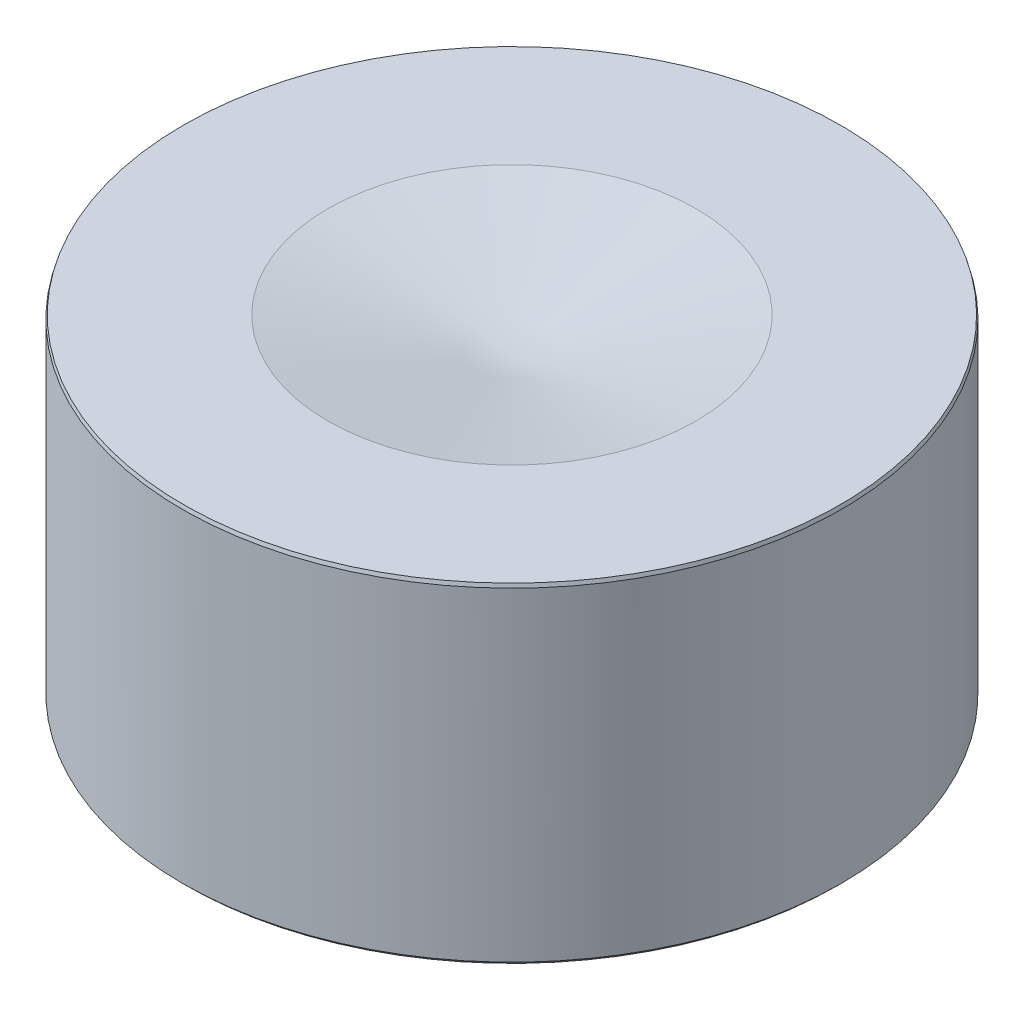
ISO-10303-21;
HEADER;
FILE_DESCRIPTION(('STEP AP214'),'2;1');
FILE_NAME('part.step','',(''),(''),'','','');
FILE_SCHEMA(('AUTOMOTIVE_DESIGN { 1 0 10303 214 1 1 1 1 }'));
ENDSEC;
DATA;
#1=APPLICATION_CONTEXT('core data for automotive mechanical design processes');
#2=APPLICATION_PROTOCOL_DEFINITION('international standard','automotive_design',2000,#1);
#3=PRODUCT_CONTEXT('',#1,'mechanical');
#4=PRODUCT('Part','Part','',(#3));
#5=PRODUCT_RELATED_PRODUCT_CATEGORY('part','',(#4));
#6=PRODUCT_DEFINITION_FORMATION('','',#4);
#7=PRODUCT_DEFINITION_CONTEXT('part definition',#1,'design');
#8=PRODUCT_DEFINITION('design','',#6,#7);
#9=PRODUCT_DEFINITION_SHAPE('','',#8);
#10=(LENGTH_UNIT() NAMED_UNIT(*) SI_UNIT(.MILLI.,.METRE.));
#11=(NAMED_UNIT(*) PLANE_ANGLE_UNIT() SI_UNIT($,.RADIAN.));
#12=(NAMED_UNIT(*) SI_UNIT($,.STERADIAN.) SOLID_ANGLE_UNIT());
#13=UNCERTAINTY_MEASURE_WITH_UNIT(LENGTH_MEASURE(1.E-05),#10,'distance_accuracy_value','');
#14=(GEOMETRIC_REPRESENTATION_CONTEXT(3) GLOBAL_UNCERTAINTY_ASSIGNED_CONTEXT((#13)) GLOBAL_UNIT_ASSIGNED_CONTEXT((#10,
#11,#12)) REPRESENTATION_CONTEXT('',''));
#15=CARTESIAN_POINT('',(0.,0.,0.));
#16=DIRECTION('',(0.,0.,1.));
#17=DIRECTION('',(1.,0.,0.));
#18=AXIS2_PLACEMENT_3D('',#15,#16,#17);
#19=CARTESIAN_POINT('',(-7.5,0.,0.));
#20=DIRECTION('',(0.,-1.,0.));
#21=DIRECTION('',(1.,0.,0.));
#22=AXIS2_PLACEMENT_3D('',#19,#20,#21);
#23=PLANE('',#22);
#24=CARTESIAN_POINT('',(0.,0.,0.));
#25=DIRECTION('',(0.,-1.,0.));
#26=DIRECTION('',(1.,0.,0.));
#27=AXIS2_PLACEMENT_3D('',#24,#25,#26);
#28=CIRCLE('',#27,8.85500000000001);
#29=CARTESIAN_POINT('',(8.85500000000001,0.,0.));
#30=VERTEX_POINT('',#29);
#31=EDGE_CURVE('E97',#30,#30,#28,.T.);
#32=ORIENTED_EDGE('',*,*,#31,.T.);
#33=EDGE_LOOP('',(#32));
#34=FACE_BOUND('',#33,.T.);
#35=CARTESIAN_POINT('',(0.,0.,0.));
#36=DIRECTION('',(0.,-1.,0.));
#37=DIRECTION('',(1.,0.,0.));
#38=AXIS2_PLACEMENT_3D('',#35,#36,#37);
#39=CIRCLE('',#38,7.6);
#40=CARTESIAN_POINT('',(7.6,0.,0.));
#41=VERTEX_POINT('',#40);
#42=EDGE_CURVE('E109',#41,#41,#39,.F.);
#43=ORIENTED_EDGE('',*,*,#42,.T.);
#44=EDGE_LOOP('',(#43));
#45=FACE_BOUND('',#44,.T.);
#46=ADVANCED_FACE('F33',(#34,#45),#23,.T.);
#47=CARTESIAN_POINT('',(0.,8.,0.));
#48=DIRECTION('',(0.,1.,0.));
#49=DIRECTION('',(-1.,0.,0.));
#50=AXIS2_PLACEMENT_3D('',#47,#48,#49);
#51=CYLINDRICAL_SURFACE('',#50,8.955);
#52=CARTESIAN_POINT('',(0.,8.9,0.));
#53=DIRECTION('',(0.,1.,0.));
#54=DIRECTION('',(-1.,0.,0.));
#55=AXIS2_PLACEMENT_3D('',#52,#53,#54);
#56=CIRCLE('',#55,8.955);
#57=CARTESIAN_POINT('',(-8.955,8.9,0.));
#58=VERTEX_POINT('',#57);
#59=EDGE_CURVE('E11',#58,#58,#56,.F.);
#60=ORIENTED_EDGE('',*,*,#59,.T.);
#61=EDGE_LOOP('',(#60));
#62=FACE_BOUND('',#61,.T.);
#63=CARTESIAN_POINT('',(0.,0.0999999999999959,0.));
#64=DIRECTION('',(0.,-1.,0.));
#65=DIRECTION('',(1.,0.,0.));
#66=AXIS2_PLACEMENT_3D('',#63,#64,#65);
#67=CIRCLE('',#66,8.955);
#68=CARTESIAN_POINT('',(8.955,0.0999999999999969,0.));
#69=VERTEX_POINT('',#68);
#70=EDGE_CURVE('E106',#69,#69,#67,.F.);
#71=ORIENTED_EDGE('',*,*,#70,.T.);
#72=EDGE_LOOP('',(#71));
#73=FACE_BOUND('',#72,.T.);
#74=ADVANCED_FACE('F56',(#62,#73),#51,.T.);
#75=CARTESIAN_POINT('',(-8.955,9.,0.));
#76=DIRECTION('',(0.,1.,0.));
#77=DIRECTION('',(-1.,0.,0.));
#78=AXIS2_PLACEMENT_3D('',#75,#76,#77);
#79=PLANE('',#78);
#80=CARTESIAN_POINT('',(0.,9.,0.));
#81=DIRECTION('',(0.,1.,0.));
#82=DIRECTION('',(-1.,0.,0.));
#83=AXIS2_PLACEMENT_3D('',#80,#81,#82);
#84=CIRCLE('',#83,8.92820508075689);
#85=CARTESIAN_POINT('',(-8.92820508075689,9.,0.));
#86=VERTEX_POINT('',#85);
#87=EDGE_CURVE('E40',#86,#86,#84,.T.);
#88=ORIENTED_EDGE('',*,*,#87,.T.);
#89=EDGE_LOOP('',(#88));
#90=FACE_BOUND('',#89,.T.);
#91=CARTESIAN_POINT('',(0.,9.,0.));
#92=DIRECTION('',(0.,1.,0.));
#93=DIRECTION('',(-1.,0.,0.));
#94=AXIS2_PLACEMENT_3D('',#91,#92,#93);
#95=CIRCLE('',#94,5.);
#96=CARTESIAN_POINT('',(-5.,9.,0.));
#97=VERTEX_POINT('',#96);
#98=EDGE_CURVE('E105',#97,#97,#95,.T.);
#99=ORIENTED_EDGE('',*,*,#98,.F.);
#100=EDGE_LOOP('',(#99));
#101=FACE_BOUND('',#100,.T.);
#102=ADVANCED_FACE('F46',(#90,#101),#79,.T.);
#103=CARTESIAN_POINT('',(0.,8.,0.));
#104=DIRECTION('',(0.,1.,0.));
#105=DIRECTION('',(-1.,0.,0.));
#106=AXIS2_PLACEMENT_3D('',#103,#104,#105);
#107=CONICAL_SURFACE('',#106,0.,1.37340076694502);
#108=ORIENTED_EDGE('',*,*,#98,.T.);
#109=EDGE_LOOP('',(#108));
#110=FACE_BOUND('',#109,.T.);
#111=CARTESIAN_POINT('',(0.,8.,0.));
#112=VERTEX_POINT('',#111);
#113=VERTEX_LOOP('',#112);
#114=FACE_BOUND('',#113,.T.);
#115=ADVANCED_FACE('F43',(#110,#114),#107,.F.);
#116=CARTESIAN_POINT('',(0.,6.,0.));
#117=DIRECTION('',(0.,-1.,0.));
#118=DIRECTION('',(1.,0.,0.));
#119=AXIS2_PLACEMENT_3D('',#116,#117,#118);
#120=PLANE('',#119);
#121=CARTESIAN_POINT('',(0.,6.,0.));
#122=DIRECTION('',(0.,-1.,0.));
#123=DIRECTION('',(1.,0.,0.));
#124=AXIS2_PLACEMENT_3D('',#121,#122,#123);
#125=CIRCLE('',#124,7.2);
#126=CARTESIAN_POINT('',(7.2,6.,0.));
#127=VERTEX_POINT('',#126);
#128=EDGE_CURVE('E88',#127,#127,#125,.T.);
#129=ORIENTED_EDGE('',*,*,#128,.T.);
#130=EDGE_LOOP('',(#129));
#131=FACE_BOUND('',#130,.T.);
#132=ADVANCED_FACE('F45',(#131),#120,.T.);
#133=CARTESIAN_POINT('',(0.,8.,0.));
#134=DIRECTION('',(0.,1.,0.));
#135=DIRECTION('',(-1.,0.,0.));
#136=AXIS2_PLACEMENT_3D('',#133,#134,#135);
#137=CYLINDRICAL_SURFACE('',#136,7.5);
#138=CARTESIAN_POINT('',(0.,5.7,0.));
#139=DIRECTION('',(0.,-1.,0.));
#140=DIRECTION('',(1.,0.,0.));
#141=AXIS2_PLACEMENT_3D('',#138,#139,#140);
#142=CIRCLE('',#141,7.5);
#143=CARTESIAN_POINT('',(7.5,5.7,0.));
#144=VERTEX_POINT('',#143);
#145=EDGE_CURVE('E91',#144,#144,#142,.F.);
#146=ORIENTED_EDGE('',*,*,#145,.T.);
#147=EDGE_LOOP('',(#146));
#148=FACE_BOUND('',#147,.T.);
#149=CARTESIAN_POINT('',(0.,0.0999999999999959,0.));
#150=DIRECTION('',(0.,-1.,0.));
#151=DIRECTION('',(1.,0.,0.));
#152=AXIS2_PLACEMENT_3D('',#149,#150,#151);
#153=CIRCLE('',#152,7.5);
#154=CARTESIAN_POINT('',(7.5,0.0999999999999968,0.));
#155=VERTEX_POINT('',#154);
#156=EDGE_CURVE('E93',#155,#155,#153,.T.);
#157=ORIENTED_EDGE('',*,*,#156,.T.);
#158=EDGE_LOOP('',(#157));
#159=FACE_BOUND('',#158,.T.);
#160=ADVANCED_FACE('F53',(#148,#159),#137,.F.);
#161=CARTESIAN_POINT('',(0.,0.0999999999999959,0.));
#162=DIRECTION('',(0.,1.,0.));
#163=DIRECTION('',(-1.,0.,0.));
#164=AXIS2_PLACEMENT_3D('',#161,#162,#163);
#165=CONICAL_SURFACE('',#164,8.955,0.785398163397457);
#166=ORIENTED_EDGE('',*,*,#31,.F.);
#167=EDGE_LOOP('',(#166));
#168=FACE_BOUND('',#167,.T.);
#169=ORIENTED_EDGE('',*,*,#70,.F.);
#170=EDGE_LOOP('',(#169));
#171=FACE_BOUND('',#170,.T.);
#172=ADVANCED_FACE('F71',(#168,#171),#165,.T.);
#173=CARTESIAN_POINT('',(0.,0.,0.));
#174=DIRECTION('',(0.,-1.,0.));
#175=DIRECTION('',(1.,0.,0.));
#176=AXIS2_PLACEMENT_3D('',#173,#174,#175);
#177=CONICAL_SURFACE('',#176,7.6,0.785398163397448);
#178=ORIENTED_EDGE('',*,*,#156,.F.);
#179=EDGE_LOOP('',(#178));
#180=FACE_BOUND('',#179,.T.);
#181=ORIENTED_EDGE('',*,*,#42,.F.);
#182=EDGE_LOOP('',(#181));
#183=FACE_BOUND('',#182,.T.);
#184=ADVANCED_FACE('F74',(#180,#183),#177,.F.);
#185=CARTESIAN_POINT('',(0.,5.7,0.));
#186=DIRECTION('',(0.,-1.,0.));
#187=DIRECTION('',(1.,0.,0.));
#188=AXIS2_PLACEMENT_3D('',#185,#186,#187);
#189=TOROIDAL_SURFACE('',#188,7.2,0.3);
#190=ORIENTED_EDGE('',*,*,#128,.F.);
#191=EDGE_LOOP('',(#190));
#192=FACE_BOUND('',#191,.T.);
#193=ORIENTED_EDGE('',*,*,#145,.F.);
#194=EDGE_LOOP('',(#193));
#195=FACE_BOUND('',#194,.T.);
#196=ADVANCED_FACE('F77',(#192,#195),#189,.F.);
#197=CARTESIAN_POINT('',(0.,9.,0.));
#198=DIRECTION('',(0.,-1.,0.));
#199=DIRECTION('',(1.,0.,0.));
#200=AXIS2_PLACEMENT_3D('',#197,#198,#199);
#201=CONICAL_SURFACE('',#200,8.92820508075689,0.26179938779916);
#202=ORIENTED_EDGE('',*,*,#59,.F.);
#203=EDGE_LOOP('',(#202));
#204=FACE_BOUND('',#203,.T.);
#205=ORIENTED_EDGE('',*,*,#87,.F.);
#206=EDGE_LOOP('',(#205));
#207=FACE_BOUND('',#206,.T.);
#208=ADVANCED_FACE('F35',(#204,#207),#201,.T.);
#209=CLOSED_SHELL('',(#46,#74,#102,#115,#132,#160,#172,#184,#196,#208));
#210=MANIFOLD_SOLID_BREP('B2',#209);
#211=ADVANCED_BREP_SHAPE_REPRESENTATION('',(#18,#210),#14);
#212=SHAPE_DEFINITION_REPRESENTATION(#9,#211);
ENDSEC;
END-ISO-10303-21;
